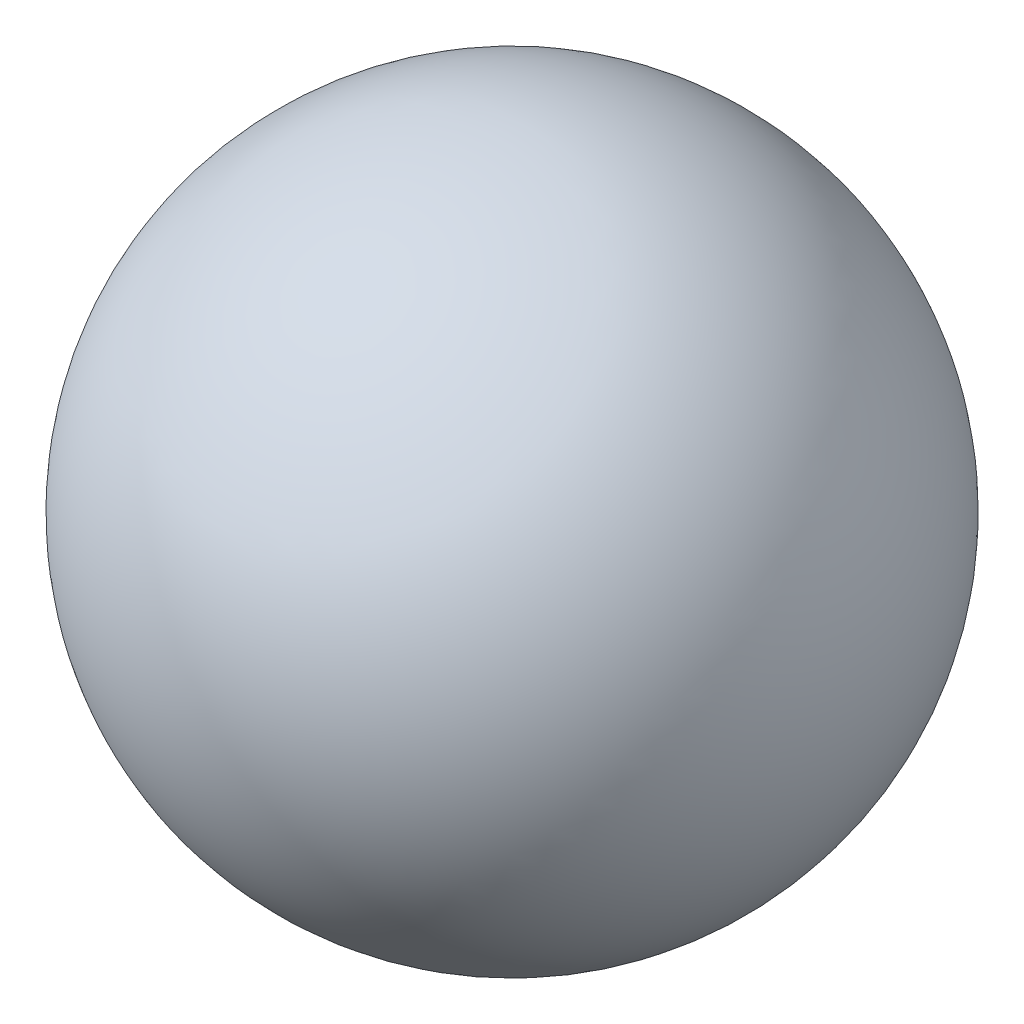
ISO-10303-21;
HEADER;
FILE_DESCRIPTION(('STEP AP214'),'2;1');
FILE_NAME('part.step','',(''),(''),'','','');
FILE_SCHEMA(('AUTOMOTIVE_DESIGN { 1 0 10303 214 1 1 1 1 }'));
ENDSEC;
DATA;
#1=APPLICATION_CONTEXT('core data for automotive mechanical design processes');
#2=APPLICATION_PROTOCOL_DEFINITION('international standard','automotive_design',2000,#1);
#3=PRODUCT_CONTEXT('',#1,'mechanical');
#4=PRODUCT('Part','Part','',(#3));
#5=PRODUCT_RELATED_PRODUCT_CATEGORY('part','',(#4));
#6=PRODUCT_DEFINITION_FORMATION('','',#4);
#7=PRODUCT_DEFINITION_CONTEXT('part definition',#1,'design');
#8=PRODUCT_DEFINITION('design','',#6,#7);
#9=PRODUCT_DEFINITION_SHAPE('','',#8);
#10=(LENGTH_UNIT() NAMED_UNIT(*) SI_UNIT(.MILLI.,.METRE.));
#11=(NAMED_UNIT(*) PLANE_ANGLE_UNIT() SI_UNIT($,.RADIAN.));
#12=(NAMED_UNIT(*) SI_UNIT($,.STERADIAN.) SOLID_ANGLE_UNIT());
#13=UNCERTAINTY_MEASURE_WITH_UNIT(LENGTH_MEASURE(1.E-05),#10,'distance_accuracy_value','');
#14=(GEOMETRIC_REPRESENTATION_CONTEXT(3) GLOBAL_UNCERTAINTY_ASSIGNED_CONTEXT((#13)) GLOBAL_UNIT_ASSIGNED_CONTEXT((#10,
#11,#12)) REPRESENTATION_CONTEXT('',''));
#15=CARTESIAN_POINT('',(0.,0.,0.));
#16=DIRECTION('',(0.,0.,1.));
#17=DIRECTION('',(1.,0.,0.));
#18=AXIS2_PLACEMENT_3D('',#15,#16,#17);
#19=CARTESIAN_POINT('',(0.,0.,0.));
#20=DIRECTION('',(0.,0.,1.));
#21=DIRECTION('',(-1.,0.,0.));
#22=AXIS2_PLACEMENT_3D('',#19,#20,#21);
#23=SPHERICAL_SURFACE('',#22,21.335);
#24=CARTESIAN_POINT('',(0.,0.,21.335));
#25=VERTEX_POINT('',#24);
#26=VERTEX_LOOP('',#25);
#27=FACE_BOUND('',#26,.T.);
#28=ADVANCED_FACE('F30',(#27),#23,.T.);
#29=CLOSED_SHELL('',(#28));
#30=MANIFOLD_SOLID_BREP('B2',#29);
#31=ADVANCED_BREP_SHAPE_REPRESENTATION('',(#18,#30),#14);
#32=SHAPE_DEFINITION_REPRESENTATION(#9,#31);
ENDSEC;
END-ISO-10303-21;
